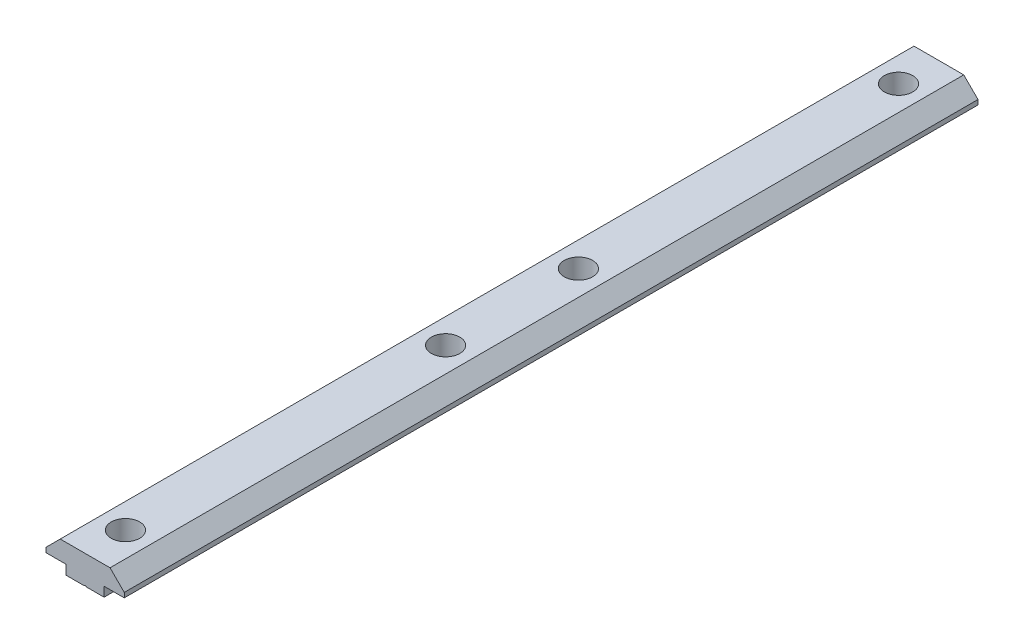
ISO-10303-21;
HEADER;
FILE_DESCRIPTION(('STEP AP214'),'2;1');
FILE_NAME('part.step','',(''),(''),'','','');
FILE_SCHEMA(('AUTOMOTIVE_DESIGN { 1 0 10303 214 1 1 1 1 }'));
ENDSEC;
DATA;
#1=APPLICATION_CONTEXT('core data for automotive mechanical design processes');
#2=APPLICATION_PROTOCOL_DEFINITION('international standard','automotive_design',2000,#1);
#3=PRODUCT_CONTEXT('',#1,'mechanical');
#4=PRODUCT('Part','Part','',(#3));
#5=PRODUCT_RELATED_PRODUCT_CATEGORY('part','',(#4));
#6=PRODUCT_DEFINITION_FORMATION('','',#4);
#7=PRODUCT_DEFINITION_CONTEXT('part definition',#1,'design');
#8=PRODUCT_DEFINITION('design','',#6,#7);
#9=PRODUCT_DEFINITION_SHAPE('','',#8);
#10=(LENGTH_UNIT() NAMED_UNIT(*) SI_UNIT(.MILLI.,.METRE.));
#11=(NAMED_UNIT(*) PLANE_ANGLE_UNIT() SI_UNIT($,.RADIAN.));
#12=(NAMED_UNIT(*) SI_UNIT($,.STERADIAN.) SOLID_ANGLE_UNIT());
#13=UNCERTAINTY_MEASURE_WITH_UNIT(LENGTH_MEASURE(1.E-05),#10,'distance_accuracy_value','');
#14=(GEOMETRIC_REPRESENTATION_CONTEXT(3) GLOBAL_UNCERTAINTY_ASSIGNED_CONTEXT((#13)) GLOBAL_UNIT_ASSIGNED_CONTEXT((#10,
#11,#12)) REPRESENTATION_CONTEXT('',''));
#15=CARTESIAN_POINT('',(0.,0.,0.));
#16=DIRECTION('',(0.,0.,1.));
#17=DIRECTION('',(1.,0.,0.));
#18=AXIS2_PLACEMENT_3D('',#15,#16,#17);
#19=CARTESIAN_POINT('',(0.00999999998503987,0.410000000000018,84.217992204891));
#20=DIRECTION('',(0.707106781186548,-0.707106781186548,1.25764385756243E-13));
#21=DIRECTION('',(0.707106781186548,0.707106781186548,0.));
#22=AXIS2_PLACEMENT_3D('',#19,#20,#21);
#23=PLANE('',#22);
#24=DIRECTION('',(0.,0.,-1.));
#25=VECTOR('',#24,1.);
#26=CARTESIAN_POINT('',(-0.200000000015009,0.200000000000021,99.));
#27=LINE('',#26,#25);
#28=CARTESIAN_POINT('',(-0.200000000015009,0.200000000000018,84.4933259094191));
#29=VERTEX_POINT('',#28);
#30=CARTESIAN_POINT('',(-0.200000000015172,0.200000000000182,90.));
#31=VERTEX_POINT('',#30);
#32=EDGE_CURVE('E195',#29,#31,#27,.F.);
#33=ORIENTED_EDGE('',*,*,#32,.F.);
#34=CARTESIAN_POINT('',(-1.4477318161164E-11,0.400000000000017,81.5));
#35=DIRECTION('',(0.707106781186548,-0.707106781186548,1.25764385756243E-13));
#36=DIRECTION('',(0.707106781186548,0.707106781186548,1.25450367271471E-13));
#37=AXIS2_PLACEMENT_3D('',#34,#35,#36);
#38=ELLIPSE('',#37,4.24264068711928,3.);
#39=CARTESIAN_POINT('',(-1.49883267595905E-11,0.399999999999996,84.5));
#40=VERTEX_POINT('',#39);
#41=EDGE_CURVE('E19',#29,#40,#38,.F.);
#42=ORIENTED_EDGE('',*,*,#41,.T.);
#43=DIRECTION('',(0.,0.,1.));
#44=VECTOR('',#43,1.);
#45=CARTESIAN_POINT('',(-1.60116467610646E-11,0.399999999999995,90.275333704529));
#46=LINE('',#45,#44);
#47=CARTESIAN_POINT('',(-1.58246014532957E-11,0.400000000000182,90.));
#48=VERTEX_POINT('',#47);
#49=EDGE_CURVE('E219',#48,#40,#46,.F.);
#50=ORIENTED_EDGE('',*,*,#49,.F.);
#51=DIRECTION('',(0.707106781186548,0.707106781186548,0.));
#52=VECTOR('',#51,1.);
#53=CARTESIAN_POINT('',(0.00999999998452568,0.410000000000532,90.));
#54=LINE('',#53,#52);
#55=EDGE_CURVE('E193',#48,#31,#54,.F.);
#56=ORIENTED_EDGE('',*,*,#55,.T.);
#57=EDGE_LOOP('',(#33,#42,#50,#56));
#58=FACE_BOUND('',#57,.T.);
#59=ADVANCED_FACE('F16',(#58),#23,.T.);
#60=CARTESIAN_POINT('',(0.0100000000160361,0.409999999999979,-90.275333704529));
#61=DIRECTION('',(0.707106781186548,-0.707106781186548,1.25764385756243E-13));
#62=DIRECTION('',(0.707106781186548,0.707106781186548,0.));
#63=AXIS2_PLACEMENT_3D('',#60,#61,#62);
#64=PLANE('',#63);
#65=DIRECTION('',(0.,0.,1.));
#66=VECTOR('',#65,1.);
#67=CARTESIAN_POINT('',(1.4985146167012E-11,0.399999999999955,-84.217992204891));
#68=LINE('',#67,#66);
#69=CARTESIAN_POINT('',(1.50105681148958E-11,0.39999999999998,-84.5));
#70=VERTEX_POINT('',#69);
#71=CARTESIAN_POINT('',(1.5661075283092E-11,0.400000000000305,-90.));
#72=VERTEX_POINT('',#71);
#73=EDGE_CURVE('E228',#70,#72,#68,.F.);
#74=ORIENTED_EDGE('',*,*,#73,.F.);
#75=CARTESIAN_POINT('',(1.4477293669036E-11,0.39999999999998,-81.5));
#76=DIRECTION('',(0.707106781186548,-0.707106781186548,1.25764385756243E-13));
#77=DIRECTION('',(0.707106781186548,0.707106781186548,1.25450367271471E-13));
#78=AXIS2_PLACEMENT_3D('',#75,#76,#77);
#79=ELLIPSE('',#78,4.24264068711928,3.);
#80=CARTESIAN_POINT('',(-0.199999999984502,0.19999999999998,-84.4933259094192));
#81=VERTEX_POINT('',#80);
#82=EDGE_CURVE('E255',#70,#81,#79,.F.);
#83=ORIENTED_EDGE('',*,*,#82,.T.);
#84=DIRECTION('',(0.,0.,-1.));
#85=VECTOR('',#84,1.);
#86=CARTESIAN_POINT('',(-0.199999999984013,0.200000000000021,99.));
#87=LINE('',#86,#85);
#88=CARTESIAN_POINT('',(-0.199999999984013,0.199999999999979,-90.0000000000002));
#89=VERTEX_POINT('',#88);
#90=EDGE_CURVE('E328',#89,#81,#87,.F.);
#91=ORIENTED_EDGE('',*,*,#90,.F.);
#92=DIRECTION('',(0.707106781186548,0.707106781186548,0.));
#93=VECTOR('',#92,1.);
#94=CARTESIAN_POINT('',(0.0100000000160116,0.410000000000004,-90.));
#95=LINE('',#94,#93);
#96=EDGE_CURVE('E192',#89,#72,#95,.T.);
#97=ORIENTED_EDGE('',*,*,#96,.T.);
#98=EDGE_LOOP('',(#74,#83,#91,#97));
#99=FACE_BOUND('',#98,.T.);
#100=ADVANCED_FACE('F682',(#99),#64,.T.);
#101=CARTESIAN_POINT('',(0.0100000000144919,0.409999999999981,-81.582341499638));
#102=DIRECTION('',(0.707106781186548,-0.707106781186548,1.25764385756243E-13));
#103=DIRECTION('',(0.707106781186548,0.707106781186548,0.));
#104=AXIS2_PLACEMENT_3D('',#101,#102,#103);
#105=PLANE('',#104);
#106=DIRECTION('',(0.,0.,-1.));
#107=VECTOR('',#106,1.);
#108=CARTESIAN_POINT('',(-0.199999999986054,0.200000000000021,99.));
#109=LINE('',#108,#107);
#110=CARTESIAN_POINT('',(-0.199999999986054,0.199999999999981,-78.5066740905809));
#111=VERTEX_POINT('',#110);
#112=CARTESIAN_POINT('',(-0.199999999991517,0.199999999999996,-16.9933259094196));
#113=VERTEX_POINT('',#112);
#114=EDGE_CURVE('E322',#111,#113,#109,.F.);
#115=ORIENTED_EDGE('',*,*,#114,.F.);
#116=CARTESIAN_POINT('',(1.4477293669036E-11,0.39999999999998,-81.5));
#117=DIRECTION('',(0.707106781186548,-0.707106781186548,1.25764385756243E-13));
#118=DIRECTION('',(0.707106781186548,0.707106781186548,1.25450367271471E-13));
#119=AXIS2_PLACEMENT_3D('',#116,#117,#118);
#120=ELLIPSE('',#119,4.24264068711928,3.);
#121=CARTESIAN_POINT('',(1.14763498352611E-11,0.40000000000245,-78.5));
#122=VERTEX_POINT('',#121);
#123=EDGE_CURVE('E252',#111,#122,#120,.F.);
#124=ORIENTED_EDGE('',*,*,#123,.T.);
#125=DIRECTION('',(0.,0.,1.));
#126=VECTOR('',#125,1.);
#127=CARTESIAN_POINT('',(2.74651280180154E-12,0.399999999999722,-13.917658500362));
#128=LINE('',#127,#126);
#129=CARTESIAN_POINT('',(3.02004942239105E-12,0.399999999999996,-17.));
#130=VERTEX_POINT('',#129);
#131=EDGE_CURVE('E231',#130,#122,#128,.F.);
#132=ORIENTED_EDGE('',*,*,#131,.F.);
#133=CARTESIAN_POINT('',(2.486886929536E-12,0.399999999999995,-14.));
#134=DIRECTION('',(0.707106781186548,-0.707106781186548,1.25764385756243E-13));
#135=DIRECTION('',(0.707106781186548,0.707106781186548,1.25450367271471E-13));
#136=AXIS2_PLACEMENT_3D('',#133,#134,#135);
#137=ELLIPSE('',#136,4.24264068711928,3.);
#138=EDGE_CURVE('E254',#130,#113,#137,.F.);
#139=ORIENTED_EDGE('',*,*,#138,.T.);
#140=EDGE_LOOP('',(#115,#124,#132,#139));
#141=FACE_BOUND('',#140,.T.);
#142=ADVANCED_FACE('F674',(#141),#105,.T.);
#143=CARTESIAN_POINT('',(0.0100000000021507,0.409999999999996,-12.107341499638));
#144=DIRECTION('',(0.707106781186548,-0.707106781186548,1.25764385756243E-13));
#145=DIRECTION('',(0.707106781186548,0.707106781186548,0.));
#146=AXIS2_PLACEMENT_3D('',#143,#144,#145);
#147=PLANE('',#146);
#148=DIRECTION('',(0.,0.,1.));
#149=VECTOR('',#148,1.);
#150=CARTESIAN_POINT('',(-2.0518898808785E-12,0.399999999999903,12.107341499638));
#151=LINE('',#150,#149);
#152=CARTESIAN_POINT('',(-1.95363697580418E-12,0.400000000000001,11.));
#153=VERTEX_POINT('',#152);
#154=CARTESIAN_POINT('',(1.24238774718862E-12,0.400000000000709,-11.));
#155=VERTEX_POINT('',#154);
#156=EDGE_CURVE('E237',#153,#155,#151,.F.);
#157=ORIENTED_EDGE('',*,*,#156,.F.);
#158=CARTESIAN_POINT('',(-2.486911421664E-12,0.400000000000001,14.));
#159=DIRECTION('',(0.707106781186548,-0.707106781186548,1.25764385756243E-13));
#160=DIRECTION('',(0.707106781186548,0.707106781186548,1.25450367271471E-13));
#161=AXIS2_PLACEMENT_3D('',#158,#159,#160);
#162=ELLIPSE('',#161,4.24264068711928,3.);
#163=CARTESIAN_POINT('',(-0.2,0.200000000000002,11.0066740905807));
#164=VERTEX_POINT('',#163);
#165=EDGE_CURVE('E248',#153,#164,#162,.F.);
#166=ORIENTED_EDGE('',*,*,#165,.T.);
#167=DIRECTION('',(0.,0.,-1.));
#168=VECTOR('',#167,1.);
#169=CARTESIAN_POINT('',(-0.199999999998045,0.200000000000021,99.));
#170=LINE('',#169,#168);
#171=CARTESIAN_POINT('',(-0.199999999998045,0.199999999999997,-11.0066740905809));
#172=VERTEX_POINT('',#171);
#173=EDGE_CURVE('E306',#172,#164,#170,.F.);
#174=ORIENTED_EDGE('',*,*,#173,.F.);
#175=CARTESIAN_POINT('',(2.486886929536E-12,0.399999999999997,-14.));
#176=DIRECTION('',(0.707106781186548,-0.707106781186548,1.25764385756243E-13));
#177=DIRECTION('',(0.707106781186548,0.707106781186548,1.25450367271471E-13));
#178=AXIS2_PLACEMENT_3D('',#175,#176,#177);
#179=ELLIPSE('',#178,4.24264068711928,3.);
#180=EDGE_CURVE('E250',#172,#155,#179,.F.);
#181=ORIENTED_EDGE('',*,*,#180,.T.);
#182=EDGE_LOOP('',(#157,#166,#174,#181));
#183=FACE_BOUND('',#182,.T.);
#184=ADVANCED_FACE('F382',(#183),#147,.T.);
#185=CARTESIAN_POINT('',(0.00999999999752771,0.410000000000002,13.917658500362));
#186=DIRECTION('',(0.707106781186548,-0.707106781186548,1.25764385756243E-13));
#187=DIRECTION('',(0.707106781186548,0.707106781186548,0.));
#188=AXIS2_PLACEMENT_3D('',#185,#186,#187);
#189=PLANE('',#188);
#190=DIRECTION('',(0.,0.,-1.));
#191=VECTOR('',#190,1.);
#192=CARTESIAN_POINT('',(-0.200000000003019,0.200000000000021,99.));
#193=LINE('',#192,#191);
#194=CARTESIAN_POINT('',(-0.200000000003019,0.200000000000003,16.9933259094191));
#195=VERTEX_POINT('',#194);
#196=CARTESIAN_POINT('',(-0.200000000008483,0.200000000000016,78.5066740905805));
#197=VERTEX_POINT('',#196);
#198=EDGE_CURVE('E206',#195,#197,#193,.F.);
#199=ORIENTED_EDGE('',*,*,#198,.F.);
#200=CARTESIAN_POINT('',(-2.486911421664E-12,0.400000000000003,14.));
#201=DIRECTION('',(0.707106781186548,-0.707106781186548,1.25764385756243E-13));
#202=DIRECTION('',(0.707106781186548,0.707106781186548,1.25450367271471E-13));
#203=AXIS2_PLACEMENT_3D('',#200,#201,#202);
#204=ELLIPSE('',#203,4.24264068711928,3.);
#205=CARTESIAN_POINT('',(-5.48783052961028E-12,0.400000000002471,17.));
#206=VERTEX_POINT('',#205);
#207=EDGE_CURVE('E244',#195,#206,#204,.F.);
#208=ORIENTED_EDGE('',*,*,#207,.T.);
#209=DIRECTION('',(0.,0.,1.));
#210=VECTOR('',#209,1.);
#211=CARTESIAN_POINT('',(-1.42176428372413E-11,0.399999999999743,81.582341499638));
#212=LINE('',#211,#210);
#213=CARTESIAN_POINT('',(-1.39440873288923E-11,0.400000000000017,78.5));
#214=VERTEX_POINT('',#213);
#215=EDGE_CURVE('E243',#214,#206,#212,.F.);
#216=ORIENTED_EDGE('',*,*,#215,.F.);
#217=CARTESIAN_POINT('',(-1.4477318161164E-11,0.400000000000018,81.5));
#218=DIRECTION('',(0.707106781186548,-0.707106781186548,1.25764385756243E-13));
#219=DIRECTION('',(0.707106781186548,0.707106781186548,1.25450367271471E-13));
#220=AXIS2_PLACEMENT_3D('',#217,#218,#219);
#221=ELLIPSE('',#220,4.24264068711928,3.);
#222=EDGE_CURVE('E246',#214,#197,#221,.F.);
#223=ORIENTED_EDGE('',*,*,#222,.T.);
#224=EDGE_LOOP('',(#199,#208,#216,#223));
#225=FACE_BOUND('',#224,.T.);
#226=ADVANCED_FACE('F316',(#225),#189,.T.);
#227=CARTESIAN_POINT('',(-0.0100000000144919,0.410000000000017,81.582341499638));
#228=DIRECTION('',(-0.707106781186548,-0.707106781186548,-1.25450367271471E-13));
#229=DIRECTION('',(0.707106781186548,-0.707106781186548,0.));
#230=AXIS2_PLACEMENT_3D('',#227,#228,#229);
#231=PLANE('',#230);
#232=DIRECTION('',(0.,0.,-1.));
#233=VECTOR('',#232,1.);
#234=CARTESIAN_POINT('',(0.199999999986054,0.200000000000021,99.0000000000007));
#235=LINE('',#234,#233);
#236=CARTESIAN_POINT('',(0.199999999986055,0.200000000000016,78.5066740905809));
#237=VERTEX_POINT('',#236);
#238=CARTESIAN_POINT('',(0.199999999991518,0.200000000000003,16.9933259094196));
#239=VERTEX_POINT('',#238);
#240=EDGE_CURVE('E317',#237,#239,#235,.T.);
#241=ORIENTED_EDGE('',*,*,#240,.F.);
#242=CARTESIAN_POINT('',(-1.4477318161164E-11,0.400000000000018,81.5));
#243=DIRECTION('',(-0.707106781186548,-0.707106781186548,-1.25450367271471E-13));
#244=DIRECTION('',(-0.707106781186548,0.707106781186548,-1.25764385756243E-13));
#245=AXIS2_PLACEMENT_3D('',#242,#243,#244);
#246=ELLIPSE('',#245,4.24264068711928,3.);
#247=EDGE_CURVE('E238',#237,#214,#246,.F.);
#248=ORIENTED_EDGE('',*,*,#247,.T.);
#249=ORIENTED_EDGE('',*,*,#215,.T.);
#250=CARTESIAN_POINT('',(-2.486911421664E-12,0.400000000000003,14.));
#251=DIRECTION('',(-0.707106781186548,-0.707106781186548,-1.25450367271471E-13));
#252=DIRECTION('',(-0.707106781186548,0.707106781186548,-1.25764385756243E-13));
#253=AXIS2_PLACEMENT_3D('',#250,#251,#252);
#254=ELLIPSE('',#253,4.24264068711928,3.);
#255=EDGE_CURVE('E241',#206,#239,#254,.F.);
#256=ORIENTED_EDGE('',*,*,#255,.T.);
#257=EDGE_LOOP('',(#241,#248,#249,#256));
#258=FACE_BOUND('',#257,.T.);
#259=ADVANCED_FACE('F651',(#258),#231,.T.);
#260=CARTESIAN_POINT('',(-0.0100000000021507,0.410000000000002,12.107341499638));
#261=DIRECTION('',(-0.707106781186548,-0.707106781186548,-1.25450367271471E-13));
#262=DIRECTION('',(0.707106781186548,-0.707106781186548,0.));
#263=AXIS2_PLACEMENT_3D('',#260,#261,#262);
#264=PLANE('',#263);
#265=DIRECTION('',(0.,0.,-1.));
#266=VECTOR('',#265,1.);
#267=CARTESIAN_POINT('',(0.199999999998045,0.200000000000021,99.0000000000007));
#268=LINE('',#267,#266);
#269=CARTESIAN_POINT('',(0.199999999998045,0.200000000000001,11.0066740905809));
#270=VERTEX_POINT('',#269);
#271=CARTESIAN_POINT('',(0.200000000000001,0.199999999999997,-11.0066740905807));
#272=VERTEX_POINT('',#271);
#273=EDGE_CURVE('E320',#270,#272,#268,.T.);
#274=ORIENTED_EDGE('',*,*,#273,.F.);
#275=CARTESIAN_POINT('',(-2.486911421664E-12,0.400000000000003,14.));
#276=DIRECTION('',(-0.707106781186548,-0.707106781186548,-1.25450367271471E-13));
#277=DIRECTION('',(-0.707106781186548,0.707106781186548,-1.25764385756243E-13));
#278=AXIS2_PLACEMENT_3D('',#275,#276,#277);
#279=ELLIPSE('',#278,4.24264068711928,3.);
#280=EDGE_CURVE('E232',#270,#153,#279,.F.);
#281=ORIENTED_EDGE('',*,*,#280,.T.);
#282=ORIENTED_EDGE('',*,*,#156,.T.);
#283=CARTESIAN_POINT('',(2.486886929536E-12,0.399999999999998,-14.));
#284=DIRECTION('',(-0.707106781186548,-0.707106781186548,-1.25450367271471E-13));
#285=DIRECTION('',(-0.707106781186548,0.707106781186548,-1.25764385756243E-13));
#286=AXIS2_PLACEMENT_3D('',#283,#284,#285);
#287=ELLIPSE('',#286,4.24264068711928,3.);
#288=EDGE_CURVE('E235',#155,#272,#287,.F.);
#289=ORIENTED_EDGE('',*,*,#288,.T.);
#290=EDGE_LOOP('',(#274,#281,#282,#289));
#291=FACE_BOUND('',#290,.T.);
#292=ADVANCED_FACE('F378',(#291),#264,.T.);
#293=CARTESIAN_POINT('',(-0.00999999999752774,0.409999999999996,-13.917658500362));
#294=DIRECTION('',(-0.707106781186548,-0.707106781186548,-1.25450367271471E-13));
#295=DIRECTION('',(0.707106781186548,-0.707106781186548,0.));
#296=AXIS2_PLACEMENT_3D('',#293,#294,#295);
#297=PLANE('',#296);
#298=DIRECTION('',(0.,0.,-1.));
#299=VECTOR('',#298,1.);
#300=CARTESIAN_POINT('',(0.200000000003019,0.200000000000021,99.0000000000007));
#301=LINE('',#300,#299);
#302=CARTESIAN_POINT('',(0.200000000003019,0.199999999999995,-16.9933259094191));
#303=VERTEX_POINT('',#302);
#304=CARTESIAN_POINT('',(0.200000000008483,0.199999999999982,-78.5066740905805));
#305=VERTEX_POINT('',#304);
#306=EDGE_CURVE('E393',#303,#305,#301,.T.);
#307=ORIENTED_EDGE('',*,*,#306,.F.);
#308=CARTESIAN_POINT('',(2.486886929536E-12,0.399999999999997,-14.));
#309=DIRECTION('',(-0.707106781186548,-0.707106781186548,-1.25450367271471E-13));
#310=DIRECTION('',(-0.707106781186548,0.707106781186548,-1.25764385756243E-13));
#311=AXIS2_PLACEMENT_3D('',#308,#309,#310);
#312=ELLIPSE('',#311,4.24264068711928,3.);
#313=EDGE_CURVE('E225',#303,#130,#312,.F.);
#314=ORIENTED_EDGE('',*,*,#313,.T.);
#315=ORIENTED_EDGE('',*,*,#131,.T.);
#316=CARTESIAN_POINT('',(1.4477293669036E-11,0.399999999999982,-81.5));
#317=DIRECTION('',(-0.707106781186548,-0.707106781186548,-1.25450367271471E-13));
#318=DIRECTION('',(-0.707106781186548,0.707106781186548,-1.25764385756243E-13));
#319=AXIS2_PLACEMENT_3D('',#316,#317,#318);
#320=ELLIPSE('',#319,4.24264068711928,3.);
#321=EDGE_CURVE('E229',#122,#305,#320,.F.);
#322=ORIENTED_EDGE('',*,*,#321,.T.);
#323=EDGE_LOOP('',(#307,#314,#315,#322));
#324=FACE_BOUND('',#323,.T.);
#325=ADVANCED_FACE('F634',(#324),#297,.T.);
#326=CARTESIAN_POINT('',(-0.00999999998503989,0.40999999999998,-84.217992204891));
#327=DIRECTION('',(-0.707106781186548,-0.707106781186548,-1.25450367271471E-13));
#328=DIRECTION('',(0.707106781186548,-0.707106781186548,0.));
#329=AXIS2_PLACEMENT_3D('',#326,#327,#328);
#330=PLANE('',#329);
#331=DIRECTION('',(0.,0.,-1.));
#332=VECTOR('',#331,1.);
#333=CARTESIAN_POINT('',(0.200000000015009,0.200000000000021,99.0000000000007));
#334=LINE('',#333,#332);
#335=CARTESIAN_POINT('',(0.200000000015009,0.19999999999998,-84.4933259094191));
#336=VERTEX_POINT('',#335);
#337=CARTESIAN_POINT('',(0.200000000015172,0.200000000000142,-90.));
#338=VERTEX_POINT('',#337);
#339=EDGE_CURVE('E395',#336,#338,#334,.T.);
#340=ORIENTED_EDGE('',*,*,#339,.F.);
#341=CARTESIAN_POINT('',(1.4477293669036E-11,0.39999999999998,-81.5));
#342=DIRECTION('',(-0.707106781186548,-0.707106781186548,-1.25450367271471E-13));
#343=DIRECTION('',(-0.707106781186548,0.707106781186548,-1.25764385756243E-13));
#344=AXIS2_PLACEMENT_3D('',#341,#342,#343);
#345=ELLIPSE('',#344,4.24264068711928,3.);
#346=EDGE_CURVE('E220',#336,#70,#345,.F.);
#347=ORIENTED_EDGE('',*,*,#346,.T.);
#348=ORIENTED_EDGE('',*,*,#73,.T.);
#349=DIRECTION('',(0.707106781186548,-0.707106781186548,0.));
#350=VECTOR('',#349,1.);
#351=CARTESIAN_POINT('',(-0.00999999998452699,0.410000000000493,-90.));
#352=LINE('',#351,#350);
#353=EDGE_CURVE('E224',#72,#338,#352,.T.);
#354=ORIENTED_EDGE('',*,*,#353,.T.);
#355=EDGE_LOOP('',(#340,#347,#348,#354));
#356=FACE_BOUND('',#355,.T.);
#357=ADVANCED_FACE('F625',(#356),#330,.T.);
#358=CARTESIAN_POINT('',(-0.0100000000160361,0.410000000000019,90.275333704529));
#359=DIRECTION('',(-0.707106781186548,-0.707106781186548,-1.25450367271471E-13));
#360=DIRECTION('',(0.707106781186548,-0.707106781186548,0.));
#361=AXIS2_PLACEMENT_3D('',#358,#359,#360);
#362=PLANE('',#361);
#363=ORIENTED_EDGE('',*,*,#49,.T.);
#364=CARTESIAN_POINT('',(-1.4477318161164E-11,0.400000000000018,81.5));
#365=DIRECTION('',(-0.707106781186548,-0.707106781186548,-1.25450367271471E-13));
#366=DIRECTION('',(-0.707106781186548,0.707106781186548,-1.25764385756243E-13));
#367=AXIS2_PLACEMENT_3D('',#364,#365,#366);
#368=ELLIPSE('',#367,4.24264068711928,3.);
#369=CARTESIAN_POINT('',(0.199999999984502,0.200000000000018,84.4933259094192));
#370=VERTEX_POINT('',#369);
#371=EDGE_CURVE('E188',#40,#370,#368,.F.);
#372=ORIENTED_EDGE('',*,*,#371,.T.);
#373=DIRECTION('',(0.,0.,-1.));
#374=VECTOR('',#373,1.);
#375=CARTESIAN_POINT('',(0.199999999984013,0.200000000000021,99.0000000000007));
#376=LINE('',#375,#374);
#377=CARTESIAN_POINT('',(0.199999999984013,0.200000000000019,90.0000000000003));
#378=VERTEX_POINT('',#377);
#379=EDGE_CURVE('E405',#378,#370,#376,.T.);
#380=ORIENTED_EDGE('',*,*,#379,.F.);
#381=DIRECTION('',(0.707106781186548,-0.707106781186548,0.));
#382=VECTOR('',#381,1.);
#383=CARTESIAN_POINT('',(-0.0100000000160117,0.410000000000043,90.));
#384=LINE('',#383,#382);
#385=EDGE_CURVE('E223',#378,#48,#384,.F.);
#386=ORIENTED_EDGE('',*,*,#385,.T.);
#387=EDGE_LOOP('',(#363,#372,#380,#386));
#388=FACE_BOUND('',#387,.T.);
#389=ADVANCED_FACE('F616',(#388),#362,.T.);
#390=CARTESIAN_POINT('',(8.25000000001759,3.24999999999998,-98.9999999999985));
#391=DIRECTION('',(1.,0.,1.776356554E-13));
#392=DIRECTION('',(1.776356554E-13,0.,-1.));
#393=AXIS2_PLACEMENT_3D('',#390,#391,#392);
#394=PLANE('',#393);
#395=DIRECTION('',(0.,0.,1.));
#396=VECTOR('',#395,1.);
#397=CARTESIAN_POINT('',(8.25000000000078,3.20000000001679,-98.9999999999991));
#398=LINE('',#397,#396);
#399=CARTESIAN_POINT('',(8.24999999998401,3.2,90.0000000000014));
#400=VERTEX_POINT('',#399);
#401=CARTESIAN_POINT('',(8.25000000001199,3.20000000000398,-89.9999999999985));
#402=VERTEX_POINT('',#401);
#403=EDGE_CURVE('E409',#400,#402,#398,.F.);
#404=ORIENTED_EDGE('',*,*,#403,.F.);
#405=DIRECTION('',(0.,1.,0.));
#406=VECTOR('',#405,1.);
#407=CARTESIAN_POINT('',(8.24999999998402,3.24999999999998,90.0000000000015));
#408=LINE('',#407,#406);
#409=CARTESIAN_POINT('',(8.24999999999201,2.20000000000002,90.0000000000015));
#410=VERTEX_POINT('',#409);
#411=EDGE_CURVE('E347',#400,#410,#408,.F.);
#412=ORIENTED_EDGE('',*,*,#411,.T.);
#413=DIRECTION('',(0.,0.,-1.));
#414=VECTOR('',#413,1.);
#415=CARTESIAN_POINT('',(8.25000000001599,2.20000000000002,99.0000000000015));
#416=LINE('',#415,#414);
#417=CARTESIAN_POINT('',(8.25000000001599,2.2,-89.9999999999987));
#418=VERTEX_POINT('',#417);
#419=EDGE_CURVE('E337',#418,#410,#416,.F.);
#420=ORIENTED_EDGE('',*,*,#419,.F.);
#421=DIRECTION('',(0.,1.,0.));
#422=VECTOR('',#421,1.);
#423=CARTESIAN_POINT('',(8.25000000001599,3.24999999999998,-89.9999999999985));
#424=LINE('',#423,#422);
#425=EDGE_CURVE('E218',#418,#402,#424,.T.);
#426=ORIENTED_EDGE('',*,*,#425,.T.);
#427=EDGE_LOOP('',(#404,#412,#420,#426));
#428=FACE_BOUND('',#427,.T.);
#429=ADVANCED_FACE('F607',(#428),#394,.T.);
#430=CARTESIAN_POINT('',(-8.25000000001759,3.25000000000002,98.9999999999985));
#431=DIRECTION('',(-1.,0.,-1.776356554E-13));
#432=DIRECTION('',(-1.776356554E-13,0.,1.));
#433=AXIS2_PLACEMENT_3D('',#430,#431,#432);
#434=PLANE('',#433);
#435=DIRECTION('',(0.,0.,-1.));
#436=VECTOR('',#435,1.);
#437=CARTESIAN_POINT('',(-8.25000000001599,2.20000000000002,98.9999999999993));
#438=LINE('',#437,#436);
#439=CARTESIAN_POINT('',(-8.25000000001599,2.2,89.9999999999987));
#440=VERTEX_POINT('',#439);
#441=CARTESIAN_POINT('',(-8.25,2.19999999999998,-90.0000000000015));
#442=VERTEX_POINT('',#441);
#443=EDGE_CURVE('E343',#440,#442,#438,.T.);
#444=ORIENTED_EDGE('',*,*,#443,.F.);
#445=DIRECTION('',(0.,1.,0.));
#446=VECTOR('',#445,1.);
#447=CARTESIAN_POINT('',(-8.25000000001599,3.25000000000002,89.9999999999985));
#448=LINE('',#447,#446);
#449=CARTESIAN_POINT('',(-8.250000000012,3.20000000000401,89.9999999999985));
#450=VERTEX_POINT('',#449);
#451=EDGE_CURVE('E345',#440,#450,#448,.T.);
#452=ORIENTED_EDGE('',*,*,#451,.T.);
#453=DIRECTION('',(0.,0.,1.));
#454=VECTOR('',#453,1.);
#455=CARTESIAN_POINT('',(-8.25000000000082,3.20000000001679,98.9999999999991));
#456=LINE('',#455,#454);
#457=CARTESIAN_POINT('',(-8.24999999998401,3.19999999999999,-90.0000000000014));
#458=VERTEX_POINT('',#457);
#459=EDGE_CURVE('E430',#458,#450,#456,.T.);
#460=ORIENTED_EDGE('',*,*,#459,.F.);
#461=DIRECTION('',(0.,1.,0.));
#462=VECTOR('',#461,1.);
#463=CARTESIAN_POINT('',(-8.24999999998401,6.49999999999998,-90.0000000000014));
#464=LINE('',#463,#462);
#465=EDGE_CURVE('E415',#442,#458,#464,.T.);
#466=ORIENTED_EDGE('',*,*,#465,.F.);
#467=EDGE_LOOP('',(#444,#452,#460,#466));
#468=FACE_BOUND('',#467,.T.);
#469=ADVANCED_FACE('F598',(#468),#434,.T.);
#470=CARTESIAN_POINT('',(-4.00000000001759,2.30000000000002,98.9999999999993));
#471=DIRECTION('',(-1.,0.,-1.776356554E-13));
#472=DIRECTION('',(-1.776356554E-13,0.,1.));
#473=AXIS2_PLACEMENT_3D('',#470,#471,#472);
#474=PLANE('',#473);
#475=DIRECTION('',(0.,0.,-1.));
#476=VECTOR('',#475,1.);
#477=CARTESIAN_POINT('',(-4.00000000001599,0.200000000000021,99.));
#478=LINE('',#477,#476);
#479=CARTESIAN_POINT('',(-4.00000000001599,0.199999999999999,89.9999999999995));
#480=VERTEX_POINT('',#479);
#481=CARTESIAN_POINT('',(-4.,0.199999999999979,-90.0000000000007));
#482=VERTEX_POINT('',#481);
#483=EDGE_CURVE('E199',#480,#482,#478,.T.);
#484=ORIENTED_EDGE('',*,*,#483,.F.);
#485=DIRECTION('',(0.,1.,0.));
#486=VECTOR('',#485,1.);
#487=CARTESIAN_POINT('',(-4.00000000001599,6.50000000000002,89.9999999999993));
#488=LINE('',#487,#486);
#489=CARTESIAN_POINT('',(-4.000000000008,2.20000000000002,89.9999999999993));
#490=VERTEX_POINT('',#489);
#491=EDGE_CURVE('E432',#480,#490,#488,.T.);
#492=ORIENTED_EDGE('',*,*,#491,.T.);
#493=DIRECTION('',(0.,0.,-1.));
#494=VECTOR('',#493,1.);
#495=CARTESIAN_POINT('',(-3.99999999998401,2.20000000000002,98.9999999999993));
#496=LINE('',#495,#494);
#497=CARTESIAN_POINT('',(-3.99999999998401,2.19999999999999,-90.0000000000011));
#498=VERTEX_POINT('',#497);
#499=EDGE_CURVE('E340',#498,#490,#496,.F.);
#500=ORIENTED_EDGE('',*,*,#499,.F.);
#501=DIRECTION('',(0.,1.,0.));
#502=VECTOR('',#501,1.);
#503=CARTESIAN_POINT('',(-3.99999999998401,6.49999999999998,-90.0000000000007));
#504=LINE('',#503,#502);
#505=EDGE_CURVE('E270',#482,#498,#504,.T.);
#506=ORIENTED_EDGE('',*,*,#505,.F.);
#507=EDGE_LOOP('',(#484,#492,#500,#506));
#508=FACE_BOUND('',#507,.T.);
#509=ADVANCED_FACE('F589',(#508),#474,.T.);
#510=CARTESIAN_POINT('',(-3.78750000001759,2.20000000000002,98.9999999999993));
#511=DIRECTION('',(0.,-1.,0.));
#512=DIRECTION('',(0.,0.,-1.));
#513=AXIS2_PLACEMENT_3D('',#510,#511,#512);
#514=PLANE('',#513);
#515=ORIENTED_EDGE('',*,*,#499,.T.);
#516=DIRECTION('',(-1.,0.,-1.776356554E-13));
#517=VECTOR('',#516,1.);
#518=CARTESIAN_POINT('',(-9.07500000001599,2.20000000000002,89.9999999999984));
#519=LINE('',#518,#517);
#520=EDGE_CURVE('E434',#490,#440,#519,.T.);
#521=ORIENTED_EDGE('',*,*,#520,.T.);
#522=ORIENTED_EDGE('',*,*,#443,.T.);
#523=DIRECTION('',(-1.,0.,-1.776356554E-13));
#524=VECTOR('',#523,1.);
#525=CARTESIAN_POINT('',(-9.07499999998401,2.19999999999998,-90.0000000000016));
#526=LINE('',#525,#524);
#527=EDGE_CURVE('E412',#498,#442,#526,.T.);
#528=ORIENTED_EDGE('',*,*,#527,.F.);
#529=EDGE_LOOP('',(#515,#521,#522,#528));
#530=FACE_BOUND('',#529,.T.);
#531=ADVANCED_FACE('F580',(#530),#514,.T.);
#532=CARTESIAN_POINT('',(8.46249999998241,2.20000000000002,99.0000000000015));
#533=DIRECTION('',(0.,-1.,0.));
#534=DIRECTION('',(0.,0.,-1.));
#535=AXIS2_PLACEMENT_3D('',#532,#533,#534);
#536=PLANE('',#535);
#537=ORIENTED_EDGE('',*,*,#419,.T.);
#538=DIRECTION('',(-1.,0.,-1.776356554E-13));
#539=VECTOR('',#538,1.);
#540=CARTESIAN_POINT('',(-9.07500000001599,2.20000000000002,89.9999999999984));
#541=LINE('',#540,#539);
#542=CARTESIAN_POINT('',(3.99999999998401,2.20000000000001,90.0000000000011));
#543=VERTEX_POINT('',#542);
#544=EDGE_CURVE('E441',#410,#543,#541,.T.);
#545=ORIENTED_EDGE('',*,*,#544,.T.);
#546=DIRECTION('',(1.776356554E-13,0.,-1.));
#547=VECTOR('',#546,1.);
#548=CARTESIAN_POINT('',(4.00000000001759,2.19999999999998,-98.9999999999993));
#549=LINE('',#548,#547);
#550=CARTESIAN_POINT('',(4.,2.19999999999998,-89.9999999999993));
#551=VERTEX_POINT('',#550);
#552=EDGE_CURVE('E200',#551,#543,#549,.F.);
#553=ORIENTED_EDGE('',*,*,#552,.F.);
#554=DIRECTION('',(-1.,0.,-1.776356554E-13));
#555=VECTOR('',#554,1.);
#556=CARTESIAN_POINT('',(-9.07499999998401,2.19999999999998,-90.0000000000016));
#557=LINE('',#556,#555);
#558=EDGE_CURVE('E420',#418,#551,#557,.T.);
#559=ORIENTED_EDGE('',*,*,#558,.F.);
#560=EDGE_LOOP('',(#537,#545,#553,#559));
#561=FACE_BOUND('',#560,.T.);
#562=ADVANCED_FACE('F571',(#561),#536,.T.);
#563=CARTESIAN_POINT('',(4.00000000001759,2.29999999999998,-98.9999999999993));
#564=DIRECTION('',(1.,0.,1.776356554E-13));
#565=DIRECTION('',(1.776356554E-13,0.,-1.));
#566=AXIS2_PLACEMENT_3D('',#563,#564,#565);
#567=PLANE('',#566);
#568=ORIENTED_EDGE('',*,*,#552,.T.);
#569=DIRECTION('',(0.,1.,0.));
#570=VECTOR('',#569,1.);
#571=CARTESIAN_POINT('',(3.99999999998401,6.50000000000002,90.0000000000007));
#572=LINE('',#571,#570);
#573=CARTESIAN_POINT('',(3.99999999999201,0.200000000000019,90.0000000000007));
#574=VERTEX_POINT('',#573);
#575=EDGE_CURVE('E359',#543,#574,#572,.F.);
#576=ORIENTED_EDGE('',*,*,#575,.T.);
#577=DIRECTION('',(0.,0.,-1.));
#578=VECTOR('',#577,1.);
#579=CARTESIAN_POINT('',(4.00000000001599,0.200000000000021,99.0000000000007));
#580=LINE('',#579,#578);
#581=CARTESIAN_POINT('',(4.00000000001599,0.199999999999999,-89.9999999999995));
#582=VERTEX_POINT('',#581);
#583=EDGE_CURVE('E402',#582,#574,#580,.F.);
#584=ORIENTED_EDGE('',*,*,#583,.F.);
#585=DIRECTION('',(0.,1.,0.));
#586=VECTOR('',#585,1.);
#587=CARTESIAN_POINT('',(4.00000000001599,6.49999999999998,-89.9999999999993));
#588=LINE('',#587,#586);
#589=EDGE_CURVE('E371',#551,#582,#588,.F.);
#590=ORIENTED_EDGE('',*,*,#589,.F.);
#591=EDGE_LOOP('',(#568,#576,#584,#590));
#592=FACE_BOUND('',#591,.T.);
#593=ADVANCED_FACE('F563',(#592),#567,.T.);
#594=CARTESIAN_POINT('',(-0.0100000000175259,0.200000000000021,99.));
#595=DIRECTION('',(0.,-1.,0.));
#596=DIRECTION('',(0.,0.,-1.));
#597=AXIS2_PLACEMENT_3D('',#594,#595,#596);
#598=PLANE('',#597);
#599=ORIENTED_EDGE('',*,*,#198,.T.);
#600=CARTESIAN_POINT('',(-1.44773059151E-11,0.200000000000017,81.5));
#601=DIRECTION('',(0.,1.,0.));
#602=DIRECTION('',(0.,0.,1.));
#603=AXIS2_PLACEMENT_3D('',#600,#601,#602);
#604=CIRCLE('',#603,3.);
#605=EDGE_CURVE('E186',#197,#29,#604,.T.);
#606=ORIENTED_EDGE('',*,*,#605,.T.);
#607=ORIENTED_EDGE('',*,*,#32,.T.);
#608=DIRECTION('',(-1.,0.,-1.776356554E-13));
#609=VECTOR('',#608,1.);
#610=CARTESIAN_POINT('',(-9.07500000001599,0.200000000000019,89.9999999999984));
#611=LINE('',#610,#609);
#612=EDGE_CURVE('E208',#31,#480,#611,.T.);
#613=ORIENTED_EDGE('',*,*,#612,.T.);
#614=ORIENTED_EDGE('',*,*,#483,.T.);
#615=DIRECTION('',(-1.,0.,-1.776356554E-13));
#616=VECTOR('',#615,1.);
#617=CARTESIAN_POINT('',(-9.07499999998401,0.199999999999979,-90.0000000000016));
#618=LINE('',#617,#616);
#619=EDGE_CURVE('E267',#89,#482,#618,.T.);
#620=ORIENTED_EDGE('',*,*,#619,.F.);
#621=ORIENTED_EDGE('',*,*,#90,.T.);
#622=CARTESIAN_POINT('',(1.44773059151E-11,0.199999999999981,-81.5));
#623=DIRECTION('',(0.,1.,0.));
#624=DIRECTION('',(0.,0.,1.));
#625=AXIS2_PLACEMENT_3D('',#622,#623,#624);
#626=CIRCLE('',#625,3.);
#627=EDGE_CURVE('E298',#81,#111,#626,.T.);
#628=ORIENTED_EDGE('',*,*,#627,.T.);
#629=ORIENTED_EDGE('',*,*,#114,.T.);
#630=CARTESIAN_POINT('',(2.4868991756E-12,0.199999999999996,-14.));
#631=DIRECTION('',(0.,1.,0.));
#632=DIRECTION('',(0.,0.,1.));
#633=AXIS2_PLACEMENT_3D('',#630,#631,#632);
#634=CIRCLE('',#633,3.);
#635=EDGE_CURVE('E292',#113,#172,#634,.T.);
#636=ORIENTED_EDGE('',*,*,#635,.T.);
#637=ORIENTED_EDGE('',*,*,#173,.T.);
#638=CARTESIAN_POINT('',(-2.4868991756E-12,0.200000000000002,14.));
#639=DIRECTION('',(0.,1.,0.));
#640=DIRECTION('',(0.,0.,1.));
#641=AXIS2_PLACEMENT_3D('',#638,#639,#640);
#642=CIRCLE('',#641,3.);
#643=EDGE_CURVE('E211',#164,#195,#642,.T.);
#644=ORIENTED_EDGE('',*,*,#643,.T.);
#645=EDGE_LOOP('',(#599,#606,#607,#613,#614,#620,#621,#628,#629,#636,#637,#644));
#646=FACE_BOUND('',#645,.T.);
#647=ADVANCED_FACE('F203',(#646),#598,.T.);
#648=CARTESIAN_POINT('',(4.18999999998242,0.200000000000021,99.0000000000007));
#649=DIRECTION('',(0.,-1.,0.));
#650=DIRECTION('',(0.,0.,-1.));
#651=AXIS2_PLACEMENT_3D('',#648,#649,#650);
#652=PLANE('',#651);
#653=ORIENTED_EDGE('',*,*,#379,.T.);
#654=CARTESIAN_POINT('',(-1.44773059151E-11,0.200000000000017,81.5));
#655=DIRECTION('',(0.,1.,0.));
#656=DIRECTION('',(0.,0.,1.));
#657=AXIS2_PLACEMENT_3D('',#654,#655,#656);
#658=CIRCLE('',#657,3.);
#659=EDGE_CURVE('E207',#370,#237,#658,.T.);
#660=ORIENTED_EDGE('',*,*,#659,.T.);
#661=ORIENTED_EDGE('',*,*,#240,.T.);
#662=CARTESIAN_POINT('',(-2.4868991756E-12,0.200000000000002,14.));
#663=DIRECTION('',(0.,1.,0.));
#664=DIRECTION('',(0.,0.,1.));
#665=AXIS2_PLACEMENT_3D('',#662,#663,#664);
#666=CIRCLE('',#665,3.);
#667=EDGE_CURVE('E301',#239,#270,#666,.T.);
#668=ORIENTED_EDGE('',*,*,#667,.T.);
#669=ORIENTED_EDGE('',*,*,#273,.T.);
#670=CARTESIAN_POINT('',(2.4868991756E-12,0.199999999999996,-14.));
#671=DIRECTION('',(0.,1.,0.));
#672=DIRECTION('',(0.,0.,1.));
#673=AXIS2_PLACEMENT_3D('',#670,#671,#672);
#674=CIRCLE('',#673,3.);
#675=EDGE_CURVE('E288',#272,#303,#674,.T.);
#676=ORIENTED_EDGE('',*,*,#675,.T.);
#677=ORIENTED_EDGE('',*,*,#306,.T.);
#678=CARTESIAN_POINT('',(1.44773059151E-11,0.199999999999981,-81.5));
#679=DIRECTION('',(0.,1.,0.));
#680=DIRECTION('',(0.,0.,1.));
#681=AXIS2_PLACEMENT_3D('',#678,#679,#680);
#682=CIRCLE('',#681,3.);
#683=EDGE_CURVE('E295',#305,#336,#682,.T.);
#684=ORIENTED_EDGE('',*,*,#683,.T.);
#685=ORIENTED_EDGE('',*,*,#339,.T.);
#686=DIRECTION('',(-1.,0.,-1.776356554E-13));
#687=VECTOR('',#686,1.);
#688=CARTESIAN_POINT('',(-9.07499999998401,0.199999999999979,-90.0000000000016));
#689=LINE('',#688,#687);
#690=EDGE_CURVE('E271',#582,#338,#689,.T.);
#691=ORIENTED_EDGE('',*,*,#690,.F.);
#692=ORIENTED_EDGE('',*,*,#583,.T.);
#693=DIRECTION('',(-1.,0.,-1.776356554E-13));
#694=VECTOR('',#693,1.);
#695=CARTESIAN_POINT('',(-9.07500000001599,0.200000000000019,89.9999999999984));
#696=LINE('',#695,#694);
#697=EDGE_CURVE('E213',#574,#378,#696,.T.);
#698=ORIENTED_EDGE('',*,*,#697,.T.);
#699=EDGE_LOOP('',(#653,#660,#661,#668,#669,#676,#677,#684,#685,#691,#692,#698));
#700=FACE_BOUND('',#699,.T.);
#701=ADVANCED_FACE('F392',(#700),#652,.T.);
#702=CARTESIAN_POINT('',(5.10000000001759,6.34999999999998,-98.9999999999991));
#703=DIRECTION('',(0.707106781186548,0.707106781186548,1.25450367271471E-13));
#704=DIRECTION('',(-0.707106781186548,0.707106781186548,0.));
#705=AXIS2_PLACEMENT_3D('',#702,#703,#704);
#706=PLANE('',#705);
#707=DIRECTION('',(0.,0.,1.));
#708=VECTOR('',#707,1.);
#709=CARTESIAN_POINT('',(5.24999999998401,6.20000000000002,98.999999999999));
#710=LINE('',#709,#708);
#711=CARTESIAN_POINT('',(5.24999999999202,6.19999999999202,90.0000000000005));
#712=VERTEX_POINT('',#711);
#713=CARTESIAN_POINT('',(5.25000000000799,6.19999999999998,-89.9999999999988));
#714=VERTEX_POINT('',#713);
#715=EDGE_CURVE('E291',#712,#714,#710,.F.);
#716=ORIENTED_EDGE('',*,*,#715,.F.);
#717=DIRECTION('',(0.707106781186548,-0.707106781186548,1.27570012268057E-13));
#718=VECTOR('',#717,1.);
#719=CARTESIAN_POINT('',(5.24999999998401,6.20000000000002,90.0000000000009));
#720=LINE('',#719,#718);
#721=EDGE_CURVE('E438',#712,#400,#720,.T.);
#722=ORIENTED_EDGE('',*,*,#721,.T.);
#723=ORIENTED_EDGE('',*,*,#403,.T.);
#724=DIRECTION('',(0.707106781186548,-0.707106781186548,1.27570012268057E-13));
#725=VECTOR('',#724,1.);
#726=CARTESIAN_POINT('',(5.25000000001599,6.19999999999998,-89.9999999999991));
#727=LINE('',#726,#725);
#728=EDGE_CURVE('E417',#714,#402,#727,.T.);
#729=ORIENTED_EDGE('',*,*,#728,.F.);
#730=EDGE_LOOP('',(#716,#722,#723,#729));
#731=FACE_BOUND('',#730,.T.);
#732=ADVANCED_FACE('F461',(#731),#706,.T.);
#733=CARTESIAN_POINT('',(-9.07499999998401,6.49999999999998,-90.0000000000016));
#734=DIRECTION('',(1.776356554E-13,0.,-1.));
#735=DIRECTION('',(-1.,0.,-1.776356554E-13));
#736=AXIS2_PLACEMENT_3D('',#733,#734,#735);
#737=PLANE('',#736);
#738=ORIENTED_EDGE('',*,*,#619,.T.);
#739=ORIENTED_EDGE('',*,*,#505,.T.);
#740=ORIENTED_EDGE('',*,*,#527,.T.);
#741=ORIENTED_EDGE('',*,*,#465,.T.);
#742=DIRECTION('',(-0.707106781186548,-0.707106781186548,0.));
#743=VECTOR('',#742,1.);
#744=CARTESIAN_POINT('',(-5.10000000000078,6.34999999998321,-90.000000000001));
#745=LINE('',#744,#743);
#746=CARTESIAN_POINT('',(-5.249999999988,6.19999999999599,-90.0000000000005));
#747=VERTEX_POINT('',#746);
#748=EDGE_CURVE('E427',#747,#458,#745,.T.);
#749=ORIENTED_EDGE('',*,*,#748,.F.);
#750=DIRECTION('',(1.,0.,0.));
#751=VECTOR('',#750,1.);
#752=CARTESIAN_POINT('',(-5.77500000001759,6.19999999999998,-89.9999999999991));
#753=LINE('',#752,#751);
#754=EDGE_CURVE('E446',#714,#747,#753,.F.);
#755=ORIENTED_EDGE('',*,*,#754,.F.);
#756=ORIENTED_EDGE('',*,*,#728,.T.);
#757=ORIENTED_EDGE('',*,*,#425,.F.);
#758=ORIENTED_EDGE('',*,*,#558,.T.);
#759=ORIENTED_EDGE('',*,*,#589,.T.);
#760=ORIENTED_EDGE('',*,*,#690,.T.);
#761=ORIENTED_EDGE('',*,*,#353,.F.);
#762=ORIENTED_EDGE('',*,*,#96,.F.);
#763=EDGE_LOOP('',(#738,#739,#740,#741,#749,#755,#756,#757,#758,#759,#760,#761,#762));
#764=FACE_BOUND('',#763,.T.);
#765=ADVANCED_FACE('F464',(#764),#737,.T.);
#766=CARTESIAN_POINT('',(-5.10000000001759,6.35000000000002,98.9999999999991));
#767=DIRECTION('',(-0.707106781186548,0.707106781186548,-1.25764385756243E-13));
#768=DIRECTION('',(-0.707106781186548,-0.707106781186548,0.));
#769=AXIS2_PLACEMENT_3D('',#766,#767,#768);
#770=PLANE('',#769);
#771=ORIENTED_EDGE('',*,*,#459,.T.);
#772=DIRECTION('',(0.707106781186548,0.707106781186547,1.24298986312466E-13));
#773=VECTOR('',#772,1.);
#774=CARTESIAN_POINT('',(-8.25000000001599,3.20000000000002,89.9999999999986));
#775=LINE('',#774,#773);
#776=CARTESIAN_POINT('',(-5.25000000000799,6.20000000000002,89.9999999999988));
#777=VERTEX_POINT('',#776);
#778=EDGE_CURVE('E34',#450,#777,#775,.T.);
#779=ORIENTED_EDGE('',*,*,#778,.T.);
#780=DIRECTION('',(0.,0.,1.));
#781=VECTOR('',#780,1.);
#782=CARTESIAN_POINT('',(-5.24999999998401,6.20000000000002,98.999999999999));
#783=LINE('',#782,#781);
#784=EDGE_CURVE('E449',#747,#777,#783,.T.);
#785=ORIENTED_EDGE('',*,*,#784,.F.);
#786=ORIENTED_EDGE('',*,*,#748,.T.);
#787=EDGE_LOOP('',(#771,#779,#785,#786));
#788=FACE_BOUND('',#787,.T.);
#789=ADVANCED_FACE('F467',(#788),#770,.T.);
#790=CARTESIAN_POINT('',(-9.07500000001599,6.50000000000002,89.9999999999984));
#791=DIRECTION('',(1.776356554E-13,0.,-1.));
#792=DIRECTION('',(-1.,0.,-1.776356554E-13));
#793=AXIS2_PLACEMENT_3D('',#790,#791,#792);
#794=PLANE('',#793);
#795=ORIENTED_EDGE('',*,*,#55,.F.);
#796=ORIENTED_EDGE('',*,*,#385,.F.);
#797=ORIENTED_EDGE('',*,*,#697,.F.);
#798=ORIENTED_EDGE('',*,*,#575,.F.);
#799=ORIENTED_EDGE('',*,*,#544,.F.);
#800=ORIENTED_EDGE('',*,*,#411,.F.);
#801=ORIENTED_EDGE('',*,*,#721,.F.);
#802=DIRECTION('',(1.,0.,0.));
#803=VECTOR('',#802,1.);
#804=CARTESIAN_POINT('',(-5.77500000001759,6.20000000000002,89.9999999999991));
#805=LINE('',#804,#803);
#806=EDGE_CURVE('E287',#777,#712,#805,.T.);
#807=ORIENTED_EDGE('',*,*,#806,.F.);
#808=ORIENTED_EDGE('',*,*,#778,.F.);
#809=ORIENTED_EDGE('',*,*,#451,.F.);
#810=ORIENTED_EDGE('',*,*,#520,.F.);
#811=ORIENTED_EDGE('',*,*,#491,.F.);
#812=ORIENTED_EDGE('',*,*,#612,.F.);
#813=EDGE_LOOP('',(#795,#796,#797,#798,#799,#800,#801,#807,#808,#809,#810,#811,#812));
#814=FACE_BOUND('',#813,.T.);
#815=ADVANCED_FACE('F457',(#814),#794,.F.);
#816=CARTESIAN_POINT('',(-1.4477691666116E-11,6.50000000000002,81.5));
#817=DIRECTION('',(0.,1.,0.));
#818=DIRECTION('',(0.,0.,1.));
#819=AXIS2_PLACEMENT_3D('',#816,#817,#818);
#820=CYLINDRICAL_SURFACE('',#819,3.);
#821=ORIENTED_EDGE('',*,*,#371,.F.);
#822=ORIENTED_EDGE('',*,*,#41,.F.);
#823=ORIENTED_EDGE('',*,*,#605,.F.);
#824=ORIENTED_EDGE('',*,*,#222,.F.);
#825=ORIENTED_EDGE('',*,*,#247,.F.);
#826=ORIENTED_EDGE('',*,*,#659,.F.);
#827=EDGE_LOOP('',(#821,#822,#823,#824,#825,#826));
#828=FACE_BOUND('',#827,.T.);
#829=CARTESIAN_POINT('',(-1.447767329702E-11,6.20000000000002,81.5));
#830=DIRECTION('',(0.,1.,0.));
#831=DIRECTION('',(0.,0.,1.));
#832=AXIS2_PLACEMENT_3D('',#829,#830,#831);
#833=CIRCLE('',#832,3.);
#834=CARTESIAN_POINT('',(-1.447767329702E-11,6.20000000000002,84.5));
#835=VERTEX_POINT('',#834);
#836=EDGE_CURVE('E284',#835,#835,#833,.F.);
#837=ORIENTED_EDGE('',*,*,#836,.F.);
#838=EDGE_LOOP('',(#837));
#839=FACE_BOUND('',#838,.T.);
#840=ADVANCED_FACE('F183',(#828,#839),#820,.F.);
#841=CARTESIAN_POINT('',(-2.487284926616E-12,6.5,14.));
#842=DIRECTION('',(0.,1.,0.));
#843=DIRECTION('',(0.,0.,1.));
#844=AXIS2_PLACEMENT_3D('',#841,#842,#843);
#845=CYLINDRICAL_SURFACE('',#844,3.);
#846=ORIENTED_EDGE('',*,*,#255,.F.);
#847=ORIENTED_EDGE('',*,*,#207,.F.);
#848=ORIENTED_EDGE('',*,*,#643,.F.);
#849=ORIENTED_EDGE('',*,*,#165,.F.);
#850=ORIENTED_EDGE('',*,*,#280,.F.);
#851=ORIENTED_EDGE('',*,*,#667,.F.);
#852=EDGE_LOOP('',(#846,#847,#848,#849,#850,#851));
#853=FACE_BOUND('',#852,.T.);
#854=CARTESIAN_POINT('',(-2.48726655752E-12,6.2,14.));
#855=DIRECTION('',(0.,1.,0.));
#856=DIRECTION('',(0.,0.,1.));
#857=AXIS2_PLACEMENT_3D('',#854,#855,#856);
#858=CIRCLE('',#857,3.);
#859=CARTESIAN_POINT('',(-2.48726655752E-12,6.2,17.));
#860=VERTEX_POINT('',#859);
#861=EDGE_CURVE('E281',#860,#860,#858,.F.);
#862=ORIENTED_EDGE('',*,*,#861,.F.);
#863=EDGE_LOOP('',(#862));
#864=FACE_BOUND('',#863,.T.);
#865=ADVANCED_FACE('F309',(#853,#864),#845,.F.);
#866=CARTESIAN_POINT('',(1.4476920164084E-11,6.49999999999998,-81.5));
#867=DIRECTION('',(0.,1.,0.));
#868=DIRECTION('',(0.,0.,1.));
#869=AXIS2_PLACEMENT_3D('',#866,#867,#868);
#870=CYLINDRICAL_SURFACE('',#869,3.);
#871=ORIENTED_EDGE('',*,*,#321,.F.);
#872=ORIENTED_EDGE('',*,*,#123,.F.);
#873=ORIENTED_EDGE('',*,*,#627,.F.);
#874=ORIENTED_EDGE('',*,*,#82,.F.);
#875=ORIENTED_EDGE('',*,*,#346,.F.);
#876=ORIENTED_EDGE('',*,*,#683,.F.);
#877=EDGE_LOOP('',(#871,#872,#873,#874,#875,#876));
#878=FACE_BOUND('',#877,.T.);
#879=CARTESIAN_POINT('',(1.447693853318E-11,6.19999999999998,-81.5));
#880=DIRECTION('',(0.,1.,0.));
#881=DIRECTION('',(0.,0.,1.));
#882=AXIS2_PLACEMENT_3D('',#879,#880,#881);
#883=CIRCLE('',#882,3.);
#884=CARTESIAN_POINT('',(1.447693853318E-11,6.19999999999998,-78.5));
#885=VERTEX_POINT('',#884);
#886=EDGE_CURVE('E25',#885,#885,#883,.F.);
#887=ORIENTED_EDGE('',*,*,#886,.F.);
#888=EDGE_LOOP('',(#887));
#889=FACE_BOUND('',#888,.T.);
#890=ADVANCED_FACE('F483',(#878,#889),#870,.F.);
#891=CARTESIAN_POINT('',(2.486513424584E-12,6.5,-14.));
#892=DIRECTION('',(0.,1.,0.));
#893=DIRECTION('',(0.,0.,1.));
#894=AXIS2_PLACEMENT_3D('',#891,#892,#893);
#895=CYLINDRICAL_SURFACE('',#894,3.);
#896=ORIENTED_EDGE('',*,*,#288,.F.);
#897=ORIENTED_EDGE('',*,*,#180,.F.);
#898=ORIENTED_EDGE('',*,*,#635,.F.);
#899=ORIENTED_EDGE('',*,*,#138,.F.);
#900=ORIENTED_EDGE('',*,*,#313,.F.);
#901=ORIENTED_EDGE('',*,*,#675,.F.);
#902=EDGE_LOOP('',(#896,#897,#898,#899,#900,#901));
#903=FACE_BOUND('',#902,.T.);
#904=CARTESIAN_POINT('',(2.48653179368E-12,6.2,-14.));
#905=DIRECTION('',(0.,1.,0.));
#906=DIRECTION('',(0.,0.,1.));
#907=AXIS2_PLACEMENT_3D('',#904,#905,#906);
#908=CIRCLE('',#907,3.);
#909=CARTESIAN_POINT('',(2.48653179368E-12,6.2,-11.));
#910=VERTEX_POINT('',#909);
#911=EDGE_CURVE('E10',#910,#910,#908,.F.);
#912=ORIENTED_EDGE('',*,*,#911,.F.);
#913=EDGE_LOOP('',(#912));
#914=FACE_BOUND('',#913,.T.);
#915=ADVANCED_FACE('F386',(#903,#914),#895,.F.);
#916=CARTESIAN_POINT('',(-5.77500000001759,6.20000000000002,98.999999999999));
#917=DIRECTION('',(0.,1.,0.));
#918=DIRECTION('',(0.,0.,1.));
#919=AXIS2_PLACEMENT_3D('',#916,#917,#918);
#920=PLANE('',#919);
#921=ORIENTED_EDGE('',*,*,#911,.T.);
#922=EDGE_LOOP('',(#921));
#923=FACE_BOUND('',#922,.T.);
#924=ORIENTED_EDGE('',*,*,#886,.T.);
#925=EDGE_LOOP('',(#924));
#926=FACE_BOUND('',#925,.T.);
#927=ORIENTED_EDGE('',*,*,#861,.T.);
#928=EDGE_LOOP('',(#927));
#929=FACE_BOUND('',#928,.T.);
#930=ORIENTED_EDGE('',*,*,#836,.T.);
#931=EDGE_LOOP('',(#930));
#932=FACE_BOUND('',#931,.T.);
#933=ORIENTED_EDGE('',*,*,#784,.T.);
#934=ORIENTED_EDGE('',*,*,#806,.T.);
#935=ORIENTED_EDGE('',*,*,#715,.T.);
#936=ORIENTED_EDGE('',*,*,#754,.T.);
#937=EDGE_LOOP('',(#933,#934,#935,#936));
#938=FACE_BOUND('',#937,.T.);
#939=ADVANCED_FACE('F454',(#923,#926,#929,#932,#938),#920,.T.);
#940=CLOSED_SHELL('',(#59,#100,#142,#184,#226,#259,#292,#325,#357,#389,#429,#469,#509,#531,#562,
#593,#647,#701,#732,#765,#789,#815,#840,#865,#890,#915,#939));
#941=MANIFOLD_SOLID_BREP('B1',#940);
#942=ADVANCED_BREP_SHAPE_REPRESENTATION('',(#18,#941),#14);
#943=SHAPE_DEFINITION_REPRESENTATION(#9,#942);
ENDSEC;
END-ISO-10303-21;
